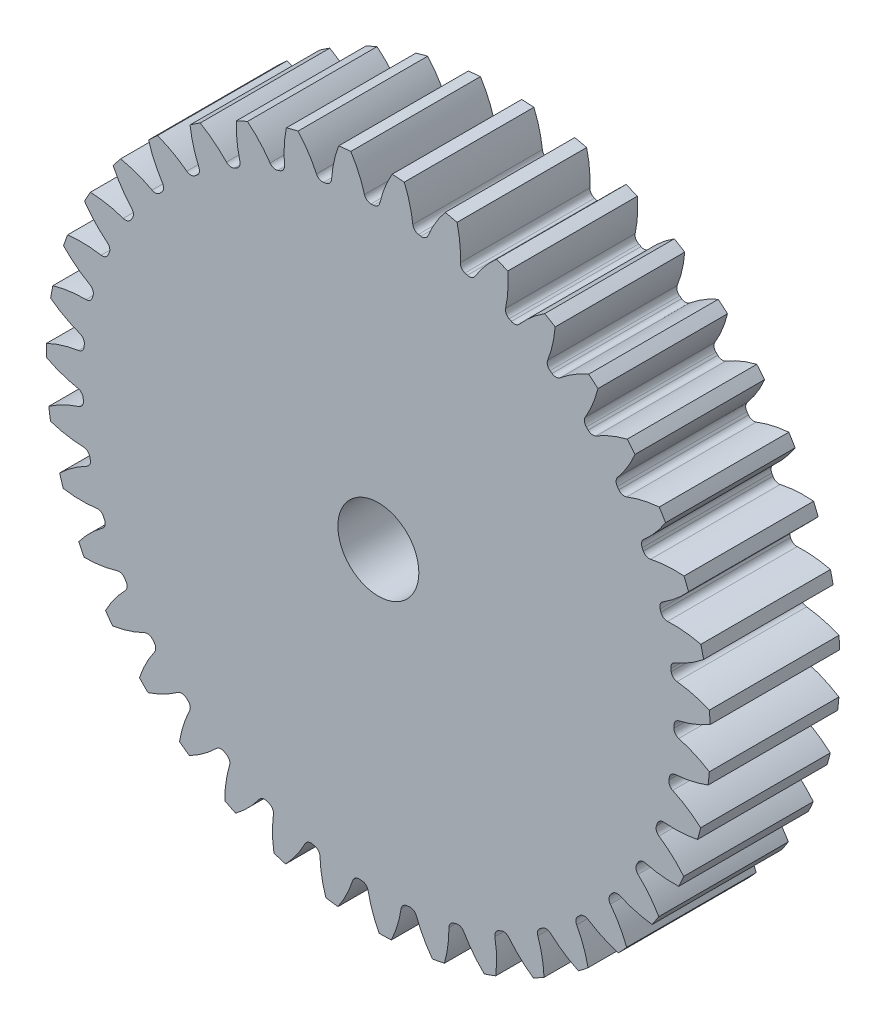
from build123d import *

# Parameters (mm, degrees)
SKETCH3_R         = 260.35
GEARBODY_DEPTH    = 101.6
TOOTHCUT_DEPTH    = 382.951312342
CIRPATTERN1_COUNT = 39
BOREDIA_R         = 31.75
BORE_DEPTH        = 12700


with BuildPart() as part:
    # Sketch3 → gearBody (new body)
    with BuildSketch(Plane.XY):
        Circle(SKETCH3_R)
    extrude(amount=GEARBODY_DEPTH)

    # Sketch2 → toothCut (cut, through all)
    with BuildSketch(Plane.XY):
        with BuildLine():
            ThreePointArc((231.709462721, -5.511398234), (231.730844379, -4.52397926), (231.748018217, -3.536478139))
            ThreePointArc((231.748018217, -3.536478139), (232.887117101, -0.377588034), (235.726739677, 1.414806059))
            ThreePointArc((235.726739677, 1.414806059), (248.402251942, 5.420599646), (260.35, 11.248661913))
            ThreePointArc((260.35, 11.248661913), (260.543245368, -5.086471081), (259.712583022, -21.401614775))
            ThreePointArc((259.712583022, -21.401614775), (248.001409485, -15.111669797), (235.491902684, -10.61420017))
            ThreePointArc((235.491902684, -10.61420017), (232.724401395, -8.712340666), (231.709462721, -5.511398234))
        make_face()
    toothcut = extrude(amount=TOOTHCUT_DEPTH, mode=Mode.SUBTRACT)

    # CirPattern1: toothCut ×39 about axis
    cirpattern1_axis = Axis((0, 0, 0), (0, 0, 1))
    for i in range(1, CIRPATTERN1_COUNT):
        add(toothcut.rotate(cirpattern1_axis, i * 360 / CIRPATTERN1_COUNT), mode=Mode.SUBTRACT)

    # boreDia → bore (cut, symmetric)
    with BuildSketch(Plane.XY):
        Circle(BOREDIA_R)
    extrude(amount=BORE_DEPTH, both=True, mode=Mode.SUBTRACT)


solid = part.part
